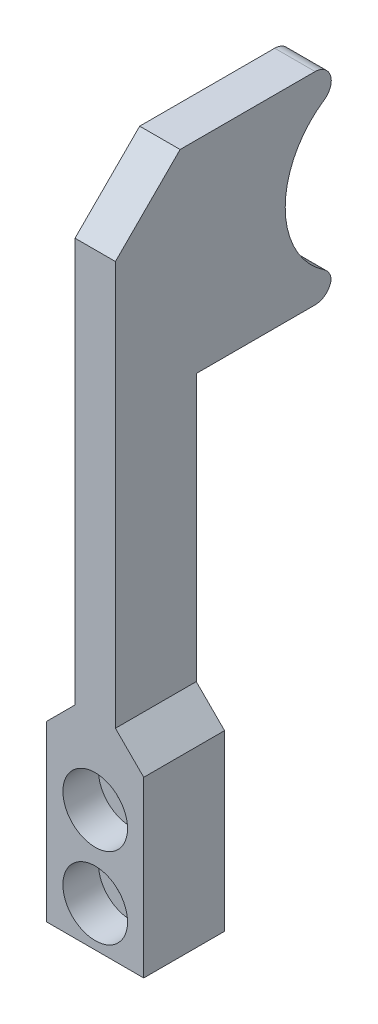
ISO-10303-21;
HEADER;
FILE_DESCRIPTION(('STEP AP214'),'2;1');
FILE_NAME('part.step','',(''),(''),'','','');
FILE_SCHEMA(('AUTOMOTIVE_DESIGN { 1 0 10303 214 1 1 1 1 }'));
ENDSEC;
DATA;
#1=APPLICATION_CONTEXT('core data for automotive mechanical design processes');
#2=APPLICATION_PROTOCOL_DEFINITION('international standard','automotive_design',2000,#1);
#3=PRODUCT_CONTEXT('',#1,'mechanical');
#4=PRODUCT('Part','Part','',(#3));
#5=PRODUCT_RELATED_PRODUCT_CATEGORY('part','',(#4));
#6=PRODUCT_DEFINITION_FORMATION('','',#4);
#7=PRODUCT_DEFINITION_CONTEXT('part definition',#1,'design');
#8=PRODUCT_DEFINITION('design','',#6,#7);
#9=PRODUCT_DEFINITION_SHAPE('','',#8);
#10=(LENGTH_UNIT() NAMED_UNIT(*) SI_UNIT(.MILLI.,.METRE.));
#11=(NAMED_UNIT(*) PLANE_ANGLE_UNIT() SI_UNIT($,.RADIAN.));
#12=(NAMED_UNIT(*) SI_UNIT($,.STERADIAN.) SOLID_ANGLE_UNIT());
#13=UNCERTAINTY_MEASURE_WITH_UNIT(LENGTH_MEASURE(1.E-05),#10,'distance_accuracy_value','');
#14=(GEOMETRIC_REPRESENTATION_CONTEXT(3) GLOBAL_UNCERTAINTY_ASSIGNED_CONTEXT((#13)) GLOBAL_UNIT_ASSIGNED_CONTEXT((#10,
#11,#12)) REPRESENTATION_CONTEXT('',''));
#15=CARTESIAN_POINT('',(0.,0.,0.));
#16=DIRECTION('',(0.,0.,1.));
#17=DIRECTION('',(1.,0.,0.));
#18=AXIS2_PLACEMENT_3D('',#15,#16,#17);
#19=CARTESIAN_POINT('',(0.,0.,24.));
#20=DIRECTION('',(0.,0.,1.));
#21=DIRECTION('',(1.,0.,0.));
#22=AXIS2_PLACEMENT_3D('',#19,#20,#21);
#23=PLANE('',#22);
#24=CARTESIAN_POINT('',(4.,-65.3,24.));
#25=DIRECTION('',(0.,0.,1.));
#26=DIRECTION('',(1.,0.,0.));
#27=AXIS2_PLACEMENT_3D('',#24,#25,#26);
#28=CIRCLE('',#27,2.25);
#29=CARTESIAN_POINT('',(6.25,-65.3,24.));
#30=VERTEX_POINT('',#29);
#31=EDGE_CURVE('E266',#30,#30,#28,.T.);
#32=ORIENTED_EDGE('',*,*,#31,.T.);
#33=EDGE_LOOP('',(#32));
#34=FACE_BOUND('',#33,.T.);
#35=CARTESIAN_POINT('',(4.,-55.3,24.));
#36=DIRECTION('',(0.,0.,1.));
#37=DIRECTION('',(1.,0.,0.));
#38=AXIS2_PLACEMENT_3D('',#35,#36,#37);
#39=CIRCLE('',#38,2.25);
#40=CARTESIAN_POINT('',(6.25,-55.3,24.));
#41=VERTEX_POINT('',#40);
#42=EDGE_CURVE('E256',#41,#41,#39,.T.);
#43=ORIENTED_EDGE('',*,*,#42,.T.);
#44=EDGE_LOOP('',(#43));
#45=FACE_BOUND('',#44,.T.);
#46=CARTESIAN_POINT('',(8.,-50.3,24.));
#47=DIRECTION('',(0.,0.,-1.));
#48=DIRECTION('',(-1.,0.,0.));
#49=AXIS2_PLACEMENT_3D('',#46,#47,#48);
#50=CIRCLE('',#49,0.999999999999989);
#51=CARTESIAN_POINT('',(8.,-51.3,24.));
#52=VERTEX_POINT('',#51);
#53=CARTESIAN_POINT('',(7.,-50.3,24.));
#54=VERTEX_POINT('',#53);
#55=EDGE_CURVE('E234',#52,#54,#50,.T.);
#56=ORIENTED_EDGE('',*,*,#55,.F.);
#57=DIRECTION('',(0.,-1.,0.));
#58=VECTOR('',#57,1.);
#59=CARTESIAN_POINT('',(8.,-70.3,24.));
#60=LINE('',#59,#58);
#61=CARTESIAN_POINT('',(8.,-70.3,24.));
#62=VERTEX_POINT('',#61);
#63=EDGE_CURVE('E291',#52,#62,#60,.T.);
#64=ORIENTED_EDGE('',*,*,#63,.T.);
#65=DIRECTION('',(-1.,0.,0.));
#66=VECTOR('',#65,1.);
#67=CARTESIAN_POINT('',(8.,-70.3,24.));
#68=LINE('',#67,#66);
#69=CARTESIAN_POINT('',(0.,-70.3,24.));
#70=VERTEX_POINT('',#69);
#71=EDGE_CURVE('E293',#62,#70,#68,.T.);
#72=ORIENTED_EDGE('',*,*,#71,.T.);
#73=DIRECTION('',(0.,1.,0.));
#74=VECTOR('',#73,1.);
#75=CARTESIAN_POINT('',(0.,-70.3,24.));
#76=LINE('',#75,#74);
#77=CARTESIAN_POINT('',(0.,-51.3,24.));
#78=VERTEX_POINT('',#77);
#79=EDGE_CURVE('E284',#70,#78,#76,.T.);
#80=ORIENTED_EDGE('',*,*,#79,.T.);
#81=CARTESIAN_POINT('',(0.,-50.3,24.));
#82=DIRECTION('',(0.,0.,-1.));
#83=DIRECTION('',(-1.,0.,0.));
#84=AXIS2_PLACEMENT_3D('',#81,#82,#83);
#85=CIRCLE('',#84,0.999999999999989);
#86=CARTESIAN_POINT('',(1.,-50.3,24.));
#87=VERTEX_POINT('',#86);
#88=EDGE_CURVE('E241',#87,#78,#85,.T.);
#89=ORIENTED_EDGE('',*,*,#88,.F.);
#90=DIRECTION('',(1.,0.,0.));
#91=VECTOR('',#90,1.);
#92=CARTESIAN_POINT('',(8.,-50.3,24.));
#93=LINE('',#92,#91);
#94=EDGE_CURVE('E287',#87,#54,#93,.T.);
#95=ORIENTED_EDGE('',*,*,#94,.T.);
#96=EDGE_LOOP('',(#56,#64,#72,#80,#89,#95));
#97=FACE_BOUND('',#96,.T.);
#98=ADVANCED_FACE('F16',(#34,#45,#97),#23,.F.);
#99=CARTESIAN_POINT('',(23.2,-12.3,3.9));
#100=DIRECTION('',(0.,1.,0.));
#101=DIRECTION('',(0.,0.,1.));
#102=AXIS2_PLACEMENT_3D('',#99,#100,#101);
#103=PLANE('',#102);
#104=DIRECTION('',(1.,0.,0.));
#105=VECTOR('',#104,1.);
#106=CARTESIAN_POINT('',(0.,-12.3,22.));
#107=LINE('',#106,#105);
#108=CARTESIAN_POINT('',(1.5,-12.3,22.));
#109=VERTEX_POINT('',#108);
#110=CARTESIAN_POINT('',(6.5,-12.3,22.));
#111=VERTEX_POINT('',#110);
#112=EDGE_CURVE('E321',#109,#111,#107,.T.);
#113=ORIENTED_EDGE('',*,*,#112,.F.);
#114=DIRECTION('',(0.,0.,-1.));
#115=VECTOR('',#114,1.);
#116=CARTESIAN_POINT('',(1.5,-12.3,3.9));
#117=LINE('',#116,#115);
#118=CARTESIAN_POINT('',(1.5,-12.3,7.3));
#119=VERTEX_POINT('',#118);
#120=EDGE_CURVE('E201',#109,#119,#117,.T.);
#121=ORIENTED_EDGE('',*,*,#120,.T.);
#122=DIRECTION('',(1.,0.,0.));
#123=VECTOR('',#122,1.);
#124=CARTESIAN_POINT('',(23.2,-12.3,7.3));
#125=LINE('',#124,#123);
#126=CARTESIAN_POINT('',(6.5,-12.3,7.3));
#127=VERTEX_POINT('',#126);
#128=EDGE_CURVE('E236',#119,#127,#125,.T.);
#129=ORIENTED_EDGE('',*,*,#128,.T.);
#130=DIRECTION('',(0.,0.,1.));
#131=VECTOR('',#130,1.);
#132=CARTESIAN_POINT('',(6.5,-12.3,3.9));
#133=LINE('',#132,#131);
#134=EDGE_CURVE('E226',#127,#111,#133,.T.);
#135=ORIENTED_EDGE('',*,*,#134,.T.);
#136=EDGE_LOOP('',(#113,#121,#129,#135));
#137=FACE_BOUND('',#136,.T.);
#138=ADVANCED_FACE('F360',(#137),#103,.F.);
#139=CARTESIAN_POINT('',(8.,0.,0.));
#140=DIRECTION('',(-1.,0.,0.));
#141=DIRECTION('',(0.,0.,1.));
#142=AXIS2_PLACEMENT_3D('',#139,#140,#141);
#143=CYLINDRICAL_SURFACE('',#142,11.);
#144=DIRECTION('',(-1.,0.,0.));
#145=VECTOR('',#144,1.);
#146=CARTESIAN_POINT('',(8.,-9.10195700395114,6.17692307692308));
#147=LINE('',#146,#145);
#148=CARTESIAN_POINT('',(6.5,-9.10195700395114,6.17692307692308));
#149=VERTEX_POINT('',#148);
#150=CARTESIAN_POINT('',(1.5,-9.10195700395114,6.17692307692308));
#151=VERTEX_POINT('',#150);
#152=EDGE_CURVE('E380',#149,#151,#147,.T.);
#153=ORIENTED_EDGE('',*,*,#152,.T.);
#154=CARTESIAN_POINT('',(1.5,0.,0.));
#155=DIRECTION('',(1.,0.,0.));
#156=DIRECTION('',(0.,1.,0.));
#157=AXIS2_PLACEMENT_3D('',#154,#155,#156);
#158=CIRCLE('',#157,11.);
#159=CARTESIAN_POINT('',(1.5,9.10195700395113,6.17692307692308));
#160=VERTEX_POINT('',#159);
#161=EDGE_CURVE('E194',#151,#160,#158,.F.);
#162=ORIENTED_EDGE('',*,*,#161,.T.);
#163=DIRECTION('',(-1.,0.,0.));
#164=VECTOR('',#163,1.);
#165=CARTESIAN_POINT('',(8.,9.10195700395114,6.17692307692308));
#166=LINE('',#165,#164);
#167=CARTESIAN_POINT('',(6.5,9.10195700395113,6.17692307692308));
#168=VERTEX_POINT('',#167);
#169=EDGE_CURVE('E384',#160,#168,#166,.F.);
#170=ORIENTED_EDGE('',*,*,#169,.T.);
#171=CARTESIAN_POINT('',(6.5,0.,0.));
#172=DIRECTION('',(-1.,0.,0.));
#173=DIRECTION('',(0.,0.,1.));
#174=AXIS2_PLACEMENT_3D('',#171,#172,#173);
#175=CIRCLE('',#174,11.);
#176=EDGE_CURVE('E218',#168,#149,#175,.F.);
#177=ORIENTED_EDGE('',*,*,#176,.T.);
#178=EDGE_LOOP('',(#153,#162,#170,#177));
#179=FACE_BOUND('',#178,.T.);
#180=ADVANCED_FACE('F407',(#179),#143,.F.);
#181=CARTESIAN_POINT('',(0.,12.7,0.));
#182=DIRECTION('',(0.,1.,0.));
#183=DIRECTION('',(0.,0.,1.));
#184=AXIS2_PLACEMENT_3D('',#181,#182,#183);
#185=PLANE('',#184);
#186=DIRECTION('',(0.,0.,1.));
#187=VECTOR('',#186,1.);
#188=CARTESIAN_POINT('',(1.5,12.7,5.30020206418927));
#189=LINE('',#188,#187);
#190=CARTESIAN_POINT('',(1.5,12.7,7.3));
#191=VERTEX_POINT('',#190);
#192=CARTESIAN_POINT('',(1.5,12.7,24.));
#193=VERTEX_POINT('',#192);
#194=EDGE_CURVE('E181',#191,#193,#189,.T.);
#195=ORIENTED_EDGE('',*,*,#194,.T.);
#196=DIRECTION('',(1.,0.,0.));
#197=VECTOR('',#196,1.);
#198=CARTESIAN_POINT('',(8.,12.7,24.));
#199=LINE('',#198,#197);
#200=CARTESIAN_POINT('',(6.5,12.7,24.));
#201=VERTEX_POINT('',#200);
#202=EDGE_CURVE('E237',#193,#201,#199,.T.);
#203=ORIENTED_EDGE('',*,*,#202,.T.);
#204=DIRECTION('',(0.,0.,1.));
#205=VECTOR('',#204,1.);
#206=CARTESIAN_POINT('',(6.5,12.7,5.30020206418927));
#207=LINE('',#206,#205);
#208=CARTESIAN_POINT('',(6.5,12.7,7.3));
#209=VERTEX_POINT('',#208);
#210=EDGE_CURVE('E210',#209,#201,#207,.T.);
#211=ORIENTED_EDGE('',*,*,#210,.F.);
#212=DIRECTION('',(1.,0.,0.));
#213=VECTOR('',#212,1.);
#214=CARTESIAN_POINT('',(0.,12.7,7.3));
#215=LINE('',#214,#213);
#216=EDGE_CURVE('E374',#209,#191,#215,.F.);
#217=ORIENTED_EDGE('',*,*,#216,.T.);
#218=EDGE_LOOP('',(#195,#203,#211,#217));
#219=FACE_BOUND('',#218,.T.);
#220=ADVANCED_FACE('F394',(#219),#185,.T.);
#221=CARTESIAN_POINT('',(19.2,12.7,32.));
#222=DIRECTION('',(0.,0.,-1.));
#223=DIRECTION('',(-1.,0.,0.));
#224=AXIS2_PLACEMENT_3D('',#221,#222,#223);
#225=PLANE('',#224);
#226=CARTESIAN_POINT('',(4.,-55.3,32.));
#227=DIRECTION('',(0.,0.,1.));
#228=DIRECTION('',(1.,0.,0.));
#229=AXIS2_PLACEMENT_3D('',#226,#227,#228);
#230=CIRCLE('',#229,4.);
#231=CARTESIAN_POINT('',(8.,-55.3,32.));
#232=VERTEX_POINT('',#231);
#233=EDGE_CURVE('E247',#232,#232,#230,.T.);
#234=ORIENTED_EDGE('',*,*,#233,.F.);
#235=EDGE_LOOP('',(#234));
#236=FACE_BOUND('',#235,.T.);
#237=CARTESIAN_POINT('',(4.,-65.3,32.));
#238=DIRECTION('',(0.,0.,1.));
#239=DIRECTION('',(1.,0.,0.));
#240=AXIS2_PLACEMENT_3D('',#237,#238,#239);
#241=CIRCLE('',#240,4.);
#242=CARTESIAN_POINT('',(8.,-65.3,32.));
#243=VERTEX_POINT('',#242);
#244=EDGE_CURVE('E257',#243,#243,#241,.T.);
#245=ORIENTED_EDGE('',*,*,#244,.F.);
#246=EDGE_LOOP('',(#245));
#247=FACE_BOUND('',#246,.T.);
#248=DIRECTION('',(0.,1.,0.));
#249=VECTOR('',#248,1.);
#250=CARTESIAN_POINT('',(1.5,-45.3,32.));
#251=LINE('',#250,#249);
#252=CARTESIAN_POINT('',(1.5,-45.3,32.));
#253=VERTEX_POINT('',#252);
#254=CARTESIAN_POINT('',(1.5,4.7,32.));
#255=VERTEX_POINT('',#254);
#256=EDGE_CURVE('E177',#253,#255,#251,.T.);
#257=ORIENTED_EDGE('',*,*,#256,.F.);
#258=DIRECTION('',(-0.707106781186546,-0.707106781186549,0.));
#259=VECTOR('',#258,1.);
#260=CARTESIAN_POINT('',(1.5,-45.3,32.));
#261=LINE('',#260,#259);
#262=CARTESIAN_POINT('',(-2.,-48.8,32.));
#263=VERTEX_POINT('',#262);
#264=EDGE_CURVE('E165',#253,#263,#261,.T.);
#265=ORIENTED_EDGE('',*,*,#264,.T.);
#266=DIRECTION('',(0.,-1.,0.));
#267=VECTOR('',#266,1.);
#268=CARTESIAN_POINT('',(-2.,-38.3,32.));
#269=LINE('',#268,#267);
#270=CARTESIAN_POINT('',(-2.,-70.3,32.));
#271=VERTEX_POINT('',#270);
#272=EDGE_CURVE('E314',#263,#271,#269,.T.);
#273=ORIENTED_EDGE('',*,*,#272,.T.);
#274=DIRECTION('',(-1.,0.,0.));
#275=VECTOR('',#274,1.);
#276=CARTESIAN_POINT('',(0.,-70.3,32.));
#277=LINE('',#276,#275);
#278=CARTESIAN_POINT('',(10.,-70.3,32.));
#279=VERTEX_POINT('',#278);
#280=EDGE_CURVE('E325',#279,#271,#277,.T.);
#281=ORIENTED_EDGE('',*,*,#280,.F.);
#282=DIRECTION('',(0.,1.,0.));
#283=VECTOR('',#282,1.);
#284=CARTESIAN_POINT('',(10.,-70.3,32.));
#285=LINE('',#284,#283);
#286=CARTESIAN_POINT('',(10.,-48.8,32.));
#287=VERTEX_POINT('',#286);
#288=EDGE_CURVE('E304',#279,#287,#285,.T.);
#289=ORIENTED_EDGE('',*,*,#288,.T.);
#290=DIRECTION('',(-0.707106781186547,0.707106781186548,0.));
#291=VECTOR('',#290,1.);
#292=CARTESIAN_POINT('',(6.5,-45.3,32.));
#293=LINE('',#292,#291);
#294=CARTESIAN_POINT('',(6.5,-45.3,32.));
#295=VERTEX_POINT('',#294);
#296=EDGE_CURVE('E172',#287,#295,#293,.T.);
#297=ORIENTED_EDGE('',*,*,#296,.T.);
#298=DIRECTION('',(0.,-1.,0.));
#299=VECTOR('',#298,1.);
#300=CARTESIAN_POINT('',(6.5,-45.3,32.));
#301=LINE('',#300,#299);
#302=CARTESIAN_POINT('',(6.5,4.7,32.));
#303=VERTEX_POINT('',#302);
#304=EDGE_CURVE('E207',#303,#295,#301,.T.);
#305=ORIENTED_EDGE('',*,*,#304,.F.);
#306=DIRECTION('',(-1.,0.,0.));
#307=VECTOR('',#306,1.);
#308=CARTESIAN_POINT('',(0.,4.7,32.));
#309=LINE('',#308,#307);
#310=EDGE_CURVE('E187',#303,#255,#309,.T.);
#311=ORIENTED_EDGE('',*,*,#310,.T.);
#312=EDGE_LOOP('',(#257,#265,#273,#281,#289,#297,#305,#311));
#313=FACE_BOUND('',#312,.T.);
#314=ADVANCED_FACE('F184',(#236,#247,#313),#225,.F.);
#315=CARTESIAN_POINT('',(0.,-70.3,22.));
#316=DIRECTION('',(0.,0.,1.));
#317=DIRECTION('',(1.,0.,0.));
#318=AXIS2_PLACEMENT_3D('',#315,#316,#317);
#319=PLANE('',#318);
#320=DIRECTION('',(0.,-1.,0.));
#321=VECTOR('',#320,1.);
#322=CARTESIAN_POINT('',(-2.,-38.3,22.));
#323=LINE('',#322,#321);
#324=CARTESIAN_POINT('',(-2.,-48.8,22.));
#325=VERTEX_POINT('',#324);
#326=CARTESIAN_POINT('',(-2.,-70.3,22.));
#327=VERTEX_POINT('',#326);
#328=EDGE_CURVE('E315',#325,#327,#323,.T.);
#329=ORIENTED_EDGE('',*,*,#328,.F.);
#330=DIRECTION('',(0.707106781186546,0.707106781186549,0.));
#331=VECTOR('',#330,1.);
#332=CARTESIAN_POINT('',(1.5,-45.3,22.));
#333=LINE('',#332,#331);
#334=CARTESIAN_POINT('',(1.5,-45.3,22.));
#335=VERTEX_POINT('',#334);
#336=EDGE_CURVE('E24',#325,#335,#333,.T.);
#337=ORIENTED_EDGE('',*,*,#336,.T.);
#338=DIRECTION('',(0.,1.,0.));
#339=VECTOR('',#338,1.);
#340=CARTESIAN_POINT('',(1.5,-70.3,22.));
#341=LINE('',#340,#339);
#342=EDGE_CURVE('E180',#335,#109,#341,.T.);
#343=ORIENTED_EDGE('',*,*,#342,.T.);
#344=ORIENTED_EDGE('',*,*,#112,.T.);
#345=DIRECTION('',(0.,-1.,0.));
#346=VECTOR('',#345,1.);
#347=CARTESIAN_POINT('',(6.5,-70.3,22.));
#348=LINE('',#347,#346);
#349=CARTESIAN_POINT('',(6.5,-45.3,22.));
#350=VERTEX_POINT('',#349);
#351=EDGE_CURVE('E229',#111,#350,#348,.T.);
#352=ORIENTED_EDGE('',*,*,#351,.T.);
#353=DIRECTION('',(0.707106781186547,-0.707106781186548,0.));
#354=VECTOR('',#353,1.);
#355=CARTESIAN_POINT('',(6.5,-45.3,22.));
#356=LINE('',#355,#354);
#357=CARTESIAN_POINT('',(10.,-48.8,22.));
#358=VERTEX_POINT('',#357);
#359=EDGE_CURVE('E31',#350,#358,#356,.T.);
#360=ORIENTED_EDGE('',*,*,#359,.T.);
#361=DIRECTION('',(0.,1.,0.));
#362=VECTOR('',#361,1.);
#363=CARTESIAN_POINT('',(10.,-70.3,22.));
#364=LINE('',#363,#362);
#365=CARTESIAN_POINT('',(10.,-70.3,22.));
#366=VERTEX_POINT('',#365);
#367=EDGE_CURVE('E307',#366,#358,#364,.T.);
#368=ORIENTED_EDGE('',*,*,#367,.F.);
#369=DIRECTION('',(1.,0.,0.));
#370=VECTOR('',#369,1.);
#371=CARTESIAN_POINT('',(0.,-70.3,22.));
#372=LINE('',#371,#370);
#373=CARTESIAN_POINT('',(8.,-70.3,22.));
#374=VERTEX_POINT('',#373);
#375=EDGE_CURVE('E326',#374,#366,#372,.T.);
#376=ORIENTED_EDGE('',*,*,#375,.F.);
#377=DIRECTION('',(0.,-1.,0.));
#378=VECTOR('',#377,1.);
#379=CARTESIAN_POINT('',(8.,-70.3,22.));
#380=LINE('',#379,#378);
#381=CARTESIAN_POINT('',(8.,-51.3,22.));
#382=VERTEX_POINT('',#381);
#383=EDGE_CURVE('E288',#382,#374,#380,.T.);
#384=ORIENTED_EDGE('',*,*,#383,.F.);
#385=CARTESIAN_POINT('',(8.,-50.3,22.));
#386=DIRECTION('',(0.,0.,-1.));
#387=DIRECTION('',(-1.,0.,0.));
#388=AXIS2_PLACEMENT_3D('',#385,#386,#387);
#389=CIRCLE('',#388,1.);
#390=CARTESIAN_POINT('',(7.,-50.3,22.));
#391=VERTEX_POINT('',#390);
#392=EDGE_CURVE('E275',#391,#382,#389,.T.);
#393=ORIENTED_EDGE('',*,*,#392,.F.);
#394=DIRECTION('',(1.,0.,0.));
#395=VECTOR('',#394,1.);
#396=CARTESIAN_POINT('',(8.,-50.3,22.));
#397=LINE('',#396,#395);
#398=CARTESIAN_POINT('',(1.,-50.3,22.));
#399=VERTEX_POINT('',#398);
#400=EDGE_CURVE('E299',#399,#391,#397,.T.);
#401=ORIENTED_EDGE('',*,*,#400,.F.);
#402=CARTESIAN_POINT('',(0.,-50.3,22.));
#403=DIRECTION('',(0.,0.,-1.));
#404=DIRECTION('',(-1.,0.,0.));
#405=AXIS2_PLACEMENT_3D('',#402,#403,#404);
#406=CIRCLE('',#405,1.);
#407=CARTESIAN_POINT('',(0.,-51.3,22.));
#408=VERTEX_POINT('',#407);
#409=EDGE_CURVE('E267',#408,#399,#406,.T.);
#410=ORIENTED_EDGE('',*,*,#409,.F.);
#411=DIRECTION('',(0.,1.,0.));
#412=VECTOR('',#411,1.);
#413=CARTESIAN_POINT('',(0.,-70.3,22.));
#414=LINE('',#413,#412);
#415=CARTESIAN_POINT('',(0.,-70.3,22.));
#416=VERTEX_POINT('',#415);
#417=EDGE_CURVE('E283',#416,#408,#414,.T.);
#418=ORIENTED_EDGE('',*,*,#417,.F.);
#419=EDGE_CURVE('E322',#327,#416,#372,.T.);
#420=ORIENTED_EDGE('',*,*,#419,.F.);
#421=EDGE_LOOP('',(#329,#337,#343,#344,#352,#360,#368,#376,#384,#393,#401,#410,#418,#420));
#422=FACE_BOUND('',#421,.T.);
#423=ADVANCED_FACE('F339',(#422),#319,.F.);
#424=CARTESIAN_POINT('',(0.,-70.3,0.));
#425=DIRECTION('',(0.,-1.,0.));
#426=DIRECTION('',(0.,0.,-1.));
#427=AXIS2_PLACEMENT_3D('',#424,#425,#426);
#428=PLANE('',#427);
#429=DIRECTION('',(0.,0.,-1.));
#430=VECTOR('',#429,1.);
#431=CARTESIAN_POINT('',(0.,-70.3,24.));
#432=LINE('',#431,#430);
#433=EDGE_CURVE('E302',#70,#416,#432,.T.);
#434=ORIENTED_EDGE('',*,*,#433,.F.);
#435=ORIENTED_EDGE('',*,*,#71,.F.);
#436=DIRECTION('',(0.,0.,-1.));
#437=VECTOR('',#436,1.);
#438=CARTESIAN_POINT('',(8.,-70.3,24.));
#439=LINE('',#438,#437);
#440=EDGE_CURVE('E296',#62,#374,#439,.T.);
#441=ORIENTED_EDGE('',*,*,#440,.T.);
#442=ORIENTED_EDGE('',*,*,#375,.T.);
#443=DIRECTION('',(0.,0.,1.));
#444=VECTOR('',#443,1.);
#445=CARTESIAN_POINT('',(10.,-70.3,22.));
#446=LINE('',#445,#444);
#447=EDGE_CURVE('E309',#366,#279,#446,.T.);
#448=ORIENTED_EDGE('',*,*,#447,.T.);
#449=ORIENTED_EDGE('',*,*,#280,.T.);
#450=DIRECTION('',(0.,0.,1.));
#451=VECTOR('',#450,1.);
#452=CARTESIAN_POINT('',(-2.,-70.3,22.));
#453=LINE('',#452,#451);
#454=EDGE_CURVE('E317',#327,#271,#453,.T.);
#455=ORIENTED_EDGE('',*,*,#454,.F.);
#456=ORIENTED_EDGE('',*,*,#419,.T.);
#457=EDGE_LOOP('',(#434,#435,#441,#442,#448,#449,#455,#456));
#458=FACE_BOUND('',#457,.T.);
#459=ADVANCED_FACE('F347',(#458),#428,.T.);
#460=CARTESIAN_POINT('',(19.2,4.7,32.));
#461=DIRECTION('',(0.,0.707106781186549,0.707106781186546));
#462=DIRECTION('',(1.,0.,0.));
#463=AXIS2_PLACEMENT_3D('',#460,#461,#462);
#464=PLANE('',#463);
#465=DIRECTION('',(0.,0.707106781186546,-0.707106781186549));
#466=VECTOR('',#465,1.);
#467=CARTESIAN_POINT('',(1.5,4.7,32.));
#468=LINE('',#467,#466);
#469=EDGE_CURVE('E205',#255,#193,#468,.T.);
#470=ORIENTED_EDGE('',*,*,#469,.F.);
#471=ORIENTED_EDGE('',*,*,#310,.F.);
#472=DIRECTION('',(0.,-0.707106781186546,0.707106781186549));
#473=VECTOR('',#472,1.);
#474=CARTESIAN_POINT('',(6.5,4.7,32.));
#475=LINE('',#474,#473);
#476=EDGE_CURVE('E231',#201,#303,#475,.T.);
#477=ORIENTED_EDGE('',*,*,#476,.F.);
#478=ORIENTED_EDGE('',*,*,#202,.F.);
#479=EDGE_LOOP('',(#470,#471,#477,#478));
#480=FACE_BOUND('',#479,.T.);
#481=ADVANCED_FACE('F397',(#480),#464,.T.);
#482=CARTESIAN_POINT('',(-2.,-38.3,22.));
#483=DIRECTION('',(-1.,0.,0.));
#484=DIRECTION('',(0.,-1.,0.));
#485=AXIS2_PLACEMENT_3D('',#482,#483,#484);
#486=PLANE('',#485);
#487=ORIENTED_EDGE('',*,*,#272,.F.);
#488=DIRECTION('',(0.,0.,-1.));
#489=VECTOR('',#488,1.);
#490=CARTESIAN_POINT('',(-2.,-48.8,22.));
#491=LINE('',#490,#489);
#492=EDGE_CURVE('E39',#263,#325,#491,.T.);
#493=ORIENTED_EDGE('',*,*,#492,.T.);
#494=ORIENTED_EDGE('',*,*,#328,.T.);
#495=ORIENTED_EDGE('',*,*,#454,.T.);
#496=EDGE_LOOP('',(#487,#493,#494,#495));
#497=FACE_BOUND('',#496,.T.);
#498=ADVANCED_FACE('F344',(#497),#486,.T.);
#499=CARTESIAN_POINT('',(10.,-70.3,22.));
#500=DIRECTION('',(1.,0.,0.));
#501=DIRECTION('',(0.,0.,-1.));
#502=AXIS2_PLACEMENT_3D('',#499,#500,#501);
#503=PLANE('',#502);
#504=ORIENTED_EDGE('',*,*,#367,.T.);
#505=DIRECTION('',(0.,0.,1.));
#506=VECTOR('',#505,1.);
#507=CARTESIAN_POINT('',(10.,-48.8,32.));
#508=LINE('',#507,#506);
#509=EDGE_CURVE('E11',#358,#287,#508,.T.);
#510=ORIENTED_EDGE('',*,*,#509,.T.);
#511=ORIENTED_EDGE('',*,*,#288,.F.);
#512=ORIENTED_EDGE('',*,*,#447,.F.);
#513=EDGE_LOOP('',(#504,#510,#511,#512));
#514=FACE_BOUND('',#513,.T.);
#515=ADVANCED_FACE('F448',(#514),#503,.T.);
#516=CARTESIAN_POINT('',(0.,-70.3,24.));
#517=DIRECTION('',(-1.,0.,0.));
#518=DIRECTION('',(0.,0.,1.));
#519=AXIS2_PLACEMENT_3D('',#516,#517,#518);
#520=PLANE('',#519);
#521=ORIENTED_EDGE('',*,*,#417,.T.);
#522=DIRECTION('',(0.,0.,-1.));
#523=VECTOR('',#522,1.);
#524=CARTESIAN_POINT('',(0.,-51.3,24.));
#525=LINE('',#524,#523);
#526=EDGE_CURVE('E272',#408,#78,#525,.F.);
#527=ORIENTED_EDGE('',*,*,#526,.T.);
#528=ORIENTED_EDGE('',*,*,#79,.F.);
#529=ORIENTED_EDGE('',*,*,#433,.T.);
#530=EDGE_LOOP('',(#521,#527,#528,#529));
#531=FACE_BOUND('',#530,.T.);
#532=ADVANCED_FACE('F441',(#531),#520,.F.);
#533=CARTESIAN_POINT('',(8.,-70.3,24.));
#534=DIRECTION('',(1.,0.,0.));
#535=DIRECTION('',(0.,0.,-1.));
#536=AXIS2_PLACEMENT_3D('',#533,#534,#535);
#537=PLANE('',#536);
#538=ORIENTED_EDGE('',*,*,#63,.F.);
#539=DIRECTION('',(0.,0.,-1.));
#540=VECTOR('',#539,1.);
#541=CARTESIAN_POINT('',(8.,-51.3,24.));
#542=LINE('',#541,#540);
#543=EDGE_CURVE('E280',#52,#382,#542,.T.);
#544=ORIENTED_EDGE('',*,*,#543,.T.);
#545=ORIENTED_EDGE('',*,*,#383,.T.);
#546=ORIENTED_EDGE('',*,*,#440,.F.);
#547=EDGE_LOOP('',(#538,#544,#545,#546));
#548=FACE_BOUND('',#547,.T.);
#549=ADVANCED_FACE('F437',(#548),#537,.F.);
#550=CARTESIAN_POINT('',(8.,-50.3,24.));
#551=DIRECTION('',(0.,1.,0.));
#552=DIRECTION('',(0.,0.,1.));
#553=AXIS2_PLACEMENT_3D('',#550,#551,#552);
#554=PLANE('',#553);
#555=ORIENTED_EDGE('',*,*,#94,.F.);
#556=DIRECTION('',(0.,0.,-1.));
#557=VECTOR('',#556,1.);
#558=CARTESIAN_POINT('',(1.,-50.3,24.));
#559=LINE('',#558,#557);
#560=EDGE_CURVE('E269',#87,#399,#559,.T.);
#561=ORIENTED_EDGE('',*,*,#560,.T.);
#562=ORIENTED_EDGE('',*,*,#400,.T.);
#563=DIRECTION('',(0.,0.,-1.));
#564=VECTOR('',#563,1.);
#565=CARTESIAN_POINT('',(7.,-50.3,24.));
#566=LINE('',#565,#564);
#567=EDGE_CURVE('E277',#391,#54,#566,.F.);
#568=ORIENTED_EDGE('',*,*,#567,.T.);
#569=EDGE_LOOP('',(#555,#561,#562,#568));
#570=FACE_BOUND('',#569,.T.);
#571=ADVANCED_FACE('F440',(#570),#554,.F.);
#572=CARTESIAN_POINT('',(8.,-50.3,24.));
#573=DIRECTION('',(0.,0.,-1.));
#574=DIRECTION('',(-1.,0.,0.));
#575=AXIS2_PLACEMENT_3D('',#572,#573,#574);
#576=CYLINDRICAL_SURFACE('',#575,1.);
#577=ORIENTED_EDGE('',*,*,#543,.F.);
#578=ORIENTED_EDGE('',*,*,#55,.T.);
#579=ORIENTED_EDGE('',*,*,#567,.F.);
#580=ORIENTED_EDGE('',*,*,#392,.T.);
#581=EDGE_LOOP('',(#577,#578,#579,#580));
#582=FACE_BOUND('',#581,.T.);
#583=CARTESIAN_POINT('',(8.,-50.3,25.));
#584=DIRECTION('',(0.,0.,-1.));
#585=DIRECTION('',(-1.,0.,0.));
#586=AXIS2_PLACEMENT_3D('',#583,#584,#585);
#587=CIRCLE('',#586,1.);
#588=CARTESIAN_POINT('',(7.,-50.3,25.));
#589=VERTEX_POINT('',#588);
#590=EDGE_CURVE('E238',#589,#589,#587,.T.);
#591=ORIENTED_EDGE('',*,*,#590,.F.);
#592=EDGE_LOOP('',(#591));
#593=FACE_BOUND('',#592,.T.);
#594=ADVANCED_FACE('F435',(#582,#593),#576,.F.);
#595=CARTESIAN_POINT('',(0.,-50.3,24.));
#596=DIRECTION('',(0.,0.,-1.));
#597=DIRECTION('',(-1.,0.,0.));
#598=AXIS2_PLACEMENT_3D('',#595,#596,#597);
#599=CYLINDRICAL_SURFACE('',#598,1.);
#600=ORIENTED_EDGE('',*,*,#409,.T.);
#601=ORIENTED_EDGE('',*,*,#560,.F.);
#602=ORIENTED_EDGE('',*,*,#88,.T.);
#603=ORIENTED_EDGE('',*,*,#526,.F.);
#604=EDGE_LOOP('',(#600,#601,#602,#603));
#605=FACE_BOUND('',#604,.T.);
#606=CARTESIAN_POINT('',(0.,-50.3,25.));
#607=DIRECTION('',(0.,0.,-1.));
#608=DIRECTION('',(-1.,0.,0.));
#609=AXIS2_PLACEMENT_3D('',#606,#607,#608);
#610=CIRCLE('',#609,1.);
#611=CARTESIAN_POINT('',(-0.999999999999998,-50.3,25.));
#612=VERTEX_POINT('',#611);
#613=EDGE_CURVE('E244',#612,#612,#610,.T.);
#614=ORIENTED_EDGE('',*,*,#613,.F.);
#615=EDGE_LOOP('',(#614));
#616=FACE_BOUND('',#615,.T.);
#617=ADVANCED_FACE('F507',(#605,#616),#599,.F.);
#618=CARTESIAN_POINT('',(4.,-65.3,32.));
#619=DIRECTION('',(0.,0.,1.));
#620=DIRECTION('',(1.,0.,0.));
#621=AXIS2_PLACEMENT_3D('',#618,#619,#620);
#622=CYLINDRICAL_SURFACE('',#621,2.25);
#623=CARTESIAN_POINT('',(4.,-65.3,27.6));
#624=DIRECTION('',(0.,0.,1.));
#625=DIRECTION('',(1.,0.,0.));
#626=AXIS2_PLACEMENT_3D('',#623,#624,#625);
#627=CIRCLE('',#626,2.25);
#628=CARTESIAN_POINT('',(6.25,-65.3,27.6));
#629=VERTEX_POINT('',#628);
#630=EDGE_CURVE('E263',#629,#629,#627,.T.);
#631=ORIENTED_EDGE('',*,*,#630,.T.);
#632=EDGE_LOOP('',(#631));
#633=FACE_BOUND('',#632,.T.);
#634=ORIENTED_EDGE('',*,*,#31,.F.);
#635=EDGE_LOOP('',(#634));
#636=FACE_BOUND('',#635,.T.);
#637=ADVANCED_FACE('F515',(#633,#636),#622,.F.);
#638=CARTESIAN_POINT('',(6.25,-65.3,27.6));
#639=DIRECTION('',(0.,0.,-1.));
#640=DIRECTION('',(-1.,0.,0.));
#641=AXIS2_PLACEMENT_3D('',#638,#639,#640);
#642=PLANE('',#641);
#643=ORIENTED_EDGE('',*,*,#630,.F.);
#644=EDGE_LOOP('',(#643));
#645=FACE_BOUND('',#644,.T.);
#646=CARTESIAN_POINT('',(4.,-65.3,27.6));
#647=DIRECTION('',(0.,0.,1.));
#648=DIRECTION('',(1.,0.,0.));
#649=AXIS2_PLACEMENT_3D('',#646,#647,#648);
#650=CIRCLE('',#649,4.);
#651=CARTESIAN_POINT('',(8.,-65.3,27.6));
#652=VERTEX_POINT('',#651);
#653=EDGE_CURVE('E260',#652,#652,#650,.T.);
#654=ORIENTED_EDGE('',*,*,#653,.T.);
#655=EDGE_LOOP('',(#654));
#656=FACE_BOUND('',#655,.T.);
#657=ADVANCED_FACE('F523',(#645,#656),#642,.F.);
#658=CARTESIAN_POINT('',(4.,-65.3,32.));
#659=DIRECTION('',(0.,0.,1.));
#660=DIRECTION('',(1.,0.,0.));
#661=AXIS2_PLACEMENT_3D('',#658,#659,#660);
#662=CYLINDRICAL_SURFACE('',#661,4.);
#663=ORIENTED_EDGE('',*,*,#653,.F.);
#664=EDGE_LOOP('',(#663));
#665=FACE_BOUND('',#664,.T.);
#666=ORIENTED_EDGE('',*,*,#244,.T.);
#667=EDGE_LOOP('',(#666));
#668=FACE_BOUND('',#667,.T.);
#669=ADVANCED_FACE('F532',(#665,#668),#662,.F.);
#670=CARTESIAN_POINT('',(4.,-55.3,32.));
#671=DIRECTION('',(0.,0.,1.));
#672=DIRECTION('',(1.,0.,0.));
#673=AXIS2_PLACEMENT_3D('',#670,#671,#672);
#674=CYLINDRICAL_SURFACE('',#673,2.25);
#675=CARTESIAN_POINT('',(4.,-55.3,27.6));
#676=DIRECTION('',(0.,0.,1.));
#677=DIRECTION('',(1.,0.,0.));
#678=AXIS2_PLACEMENT_3D('',#675,#676,#677);
#679=CIRCLE('',#678,2.25);
#680=CARTESIAN_POINT('',(6.25,-55.3,27.6));
#681=VERTEX_POINT('',#680);
#682=EDGE_CURVE('E253',#681,#681,#679,.T.);
#683=ORIENTED_EDGE('',*,*,#682,.T.);
#684=EDGE_LOOP('',(#683));
#685=FACE_BOUND('',#684,.T.);
#686=ORIENTED_EDGE('',*,*,#42,.F.);
#687=EDGE_LOOP('',(#686));
#688=FACE_BOUND('',#687,.T.);
#689=ADVANCED_FACE('F541',(#685,#688),#674,.F.);
#690=CARTESIAN_POINT('',(6.25,-55.3,27.6));
#691=DIRECTION('',(0.,0.,-1.));
#692=DIRECTION('',(-1.,0.,0.));
#693=AXIS2_PLACEMENT_3D('',#690,#691,#692);
#694=PLANE('',#693);
#695=ORIENTED_EDGE('',*,*,#682,.F.);
#696=EDGE_LOOP('',(#695));
#697=FACE_BOUND('',#696,.T.);
#698=CARTESIAN_POINT('',(4.,-55.3,27.6));
#699=DIRECTION('',(0.,0.,1.));
#700=DIRECTION('',(1.,0.,0.));
#701=AXIS2_PLACEMENT_3D('',#698,#699,#700);
#702=CIRCLE('',#701,4.);
#703=CARTESIAN_POINT('',(8.,-55.3,27.6));
#704=VERTEX_POINT('',#703);
#705=EDGE_CURVE('E250',#704,#704,#702,.T.);
#706=ORIENTED_EDGE('',*,*,#705,.T.);
#707=EDGE_LOOP('',(#706));
#708=FACE_BOUND('',#707,.T.);
#709=ADVANCED_FACE('F550',(#697,#708),#694,.F.);
#710=CARTESIAN_POINT('',(4.,-55.3,32.));
#711=DIRECTION('',(0.,0.,1.));
#712=DIRECTION('',(1.,0.,0.));
#713=AXIS2_PLACEMENT_3D('',#710,#711,#712);
#714=CYLINDRICAL_SURFACE('',#713,4.);
#715=ORIENTED_EDGE('',*,*,#705,.F.);
#716=EDGE_LOOP('',(#715));
#717=FACE_BOUND('',#716,.T.);
#718=ORIENTED_EDGE('',*,*,#233,.T.);
#719=EDGE_LOOP('',(#718));
#720=FACE_BOUND('',#719,.T.);
#721=ADVANCED_FACE('F559',(#717,#720),#714,.F.);
#722=CARTESIAN_POINT('',(0.,-50.3,25.));
#723=DIRECTION('',(0.,0.,-1.));
#724=DIRECTION('',(-1.,0.,0.));
#725=AXIS2_PLACEMENT_3D('',#722,#723,#724);
#726=CONICAL_SURFACE('',#725,1.,1.02974425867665);
#727=CARTESIAN_POINT('',(0.,-50.3,25.6008606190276));
#728=VERTEX_POINT('',#727);
#729=VERTEX_LOOP('',#728);
#730=FACE_BOUND('',#729,.T.);
#731=ORIENTED_EDGE('',*,*,#613,.T.);
#732=EDGE_LOOP('',(#731));
#733=FACE_BOUND('',#732,.T.);
#734=ADVANCED_FACE('F420',(#730,#733),#726,.F.);
#735=CARTESIAN_POINT('',(8.,-50.3,25.));
#736=DIRECTION('',(0.,0.,-1.));
#737=DIRECTION('',(-1.,0.,0.));
#738=AXIS2_PLACEMENT_3D('',#735,#736,#737);
#739=CONICAL_SURFACE('',#738,1.,1.02974425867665);
#740=CARTESIAN_POINT('',(8.,-50.3,25.6008606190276));
#741=VERTEX_POINT('',#740);
#742=VERTEX_LOOP('',#741);
#743=FACE_BOUND('',#742,.T.);
#744=ORIENTED_EDGE('',*,*,#590,.T.);
#745=EDGE_LOOP('',(#744));
#746=FACE_BOUND('',#745,.T.);
#747=ADVANCED_FACE('F411',(#743,#746),#739,.F.);
#748=CARTESIAN_POINT('',(8.,-10.7568582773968,7.3));
#749=DIRECTION('',(-1.,0.,0.));
#750=DIRECTION('',(0.,0.,1.));
#751=AXIS2_PLACEMENT_3D('',#748,#749,#750);
#752=CYLINDRICAL_SURFACE('',#751,2.);
#753=CARTESIAN_POINT('',(1.5,-10.7568582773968,7.3));
#754=DIRECTION('',(1.,0.,0.));
#755=DIRECTION('',(0.,1.,0.));
#756=AXIS2_PLACEMENT_3D('',#753,#754,#755);
#757=CIRCLE('',#756,2.);
#758=CARTESIAN_POINT('',(1.5,-10.5284291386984,5.31308779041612));
#759=VERTEX_POINT('',#758);
#760=EDGE_CURVE('E197',#151,#759,#757,.F.);
#761=ORIENTED_EDGE('',*,*,#760,.F.);
#762=ORIENTED_EDGE('',*,*,#152,.F.);
#763=CARTESIAN_POINT('',(6.5,-10.7568582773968,7.3));
#764=DIRECTION('',(-1.,0.,0.));
#765=DIRECTION('',(0.,0.,1.));
#766=AXIS2_PLACEMENT_3D('',#763,#764,#765);
#767=CIRCLE('',#766,2.);
#768=CARTESIAN_POINT('',(6.5,-10.5284291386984,5.31308779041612));
#769=VERTEX_POINT('',#768);
#770=EDGE_CURVE('E221',#769,#149,#767,.F.);
#771=ORIENTED_EDGE('',*,*,#770,.F.);
#772=DIRECTION('',(-1.,0.,0.));
#773=VECTOR('',#772,1.);
#774=CARTESIAN_POINT('',(4.,-10.5284291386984,5.31308779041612));
#775=LINE('',#774,#773);
#776=EDGE_CURVE('E242',#759,#769,#775,.F.);
#777=ORIENTED_EDGE('',*,*,#776,.F.);
#778=EDGE_LOOP('',(#761,#762,#771,#777));
#779=FACE_BOUND('',#778,.T.);
#780=ADVANCED_FACE('F409',(#779),#752,.T.);
#781=CARTESIAN_POINT('',(23.2,-10.3,7.3));
#782=DIRECTION('',(1.,0.,0.));
#783=DIRECTION('',(0.,0.,-1.));
#784=AXIS2_PLACEMENT_3D('',#781,#782,#783);
#785=CYLINDRICAL_SURFACE('',#784,2.);
#786=CARTESIAN_POINT('',(1.5,-10.3,7.3));
#787=DIRECTION('',(1.,0.,0.));
#788=DIRECTION('',(0.,1.,0.));
#789=AXIS2_PLACEMENT_3D('',#786,#787,#788);
#790=CIRCLE('',#789,2.);
#791=EDGE_CURVE('E199',#759,#119,#790,.F.);
#792=ORIENTED_EDGE('',*,*,#791,.F.);
#793=ORIENTED_EDGE('',*,*,#776,.T.);
#794=CARTESIAN_POINT('',(6.5,-10.3,7.3));
#795=DIRECTION('',(-1.,0.,0.));
#796=DIRECTION('',(0.,0.,1.));
#797=AXIS2_PLACEMENT_3D('',#794,#795,#796);
#798=CIRCLE('',#797,2.);
#799=EDGE_CURVE('E223',#127,#769,#798,.F.);
#800=ORIENTED_EDGE('',*,*,#799,.F.);
#801=ORIENTED_EDGE('',*,*,#128,.F.);
#802=EDGE_LOOP('',(#792,#793,#800,#801));
#803=FACE_BOUND('',#802,.T.);
#804=ADVANCED_FACE('F366',(#803),#785,.T.);
#805=CARTESIAN_POINT('',(8.,10.7568582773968,7.3));
#806=DIRECTION('',(-1.,0.,0.));
#807=DIRECTION('',(0.,0.,1.));
#808=AXIS2_PLACEMENT_3D('',#805,#806,#807);
#809=CYLINDRICAL_SURFACE('',#808,2.);
#810=CARTESIAN_POINT('',(1.5,10.7568582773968,7.3));
#811=DIRECTION('',(1.,0.,0.));
#812=DIRECTION('',(0.,1.,0.));
#813=AXIS2_PLACEMENT_3D('',#810,#811,#812);
#814=CIRCLE('',#813,2.);
#815=CARTESIAN_POINT('',(1.5,10.7284291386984,5.30020206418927));
#816=VERTEX_POINT('',#815);
#817=EDGE_CURVE('E191',#816,#160,#814,.F.);
#818=ORIENTED_EDGE('',*,*,#817,.F.);
#819=DIRECTION('',(-1.,0.,0.));
#820=VECTOR('',#819,1.);
#821=CARTESIAN_POINT('',(4.,10.7284291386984,5.30020206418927));
#822=LINE('',#821,#820);
#823=CARTESIAN_POINT('',(6.5,10.7284291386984,5.30020206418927));
#824=VERTEX_POINT('',#823);
#825=EDGE_CURVE('E233',#824,#816,#822,.T.);
#826=ORIENTED_EDGE('',*,*,#825,.F.);
#827=CARTESIAN_POINT('',(6.5,10.7568582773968,7.3));
#828=DIRECTION('',(-1.,0.,0.));
#829=DIRECTION('',(0.,0.,1.));
#830=AXIS2_PLACEMENT_3D('',#827,#828,#829);
#831=CIRCLE('',#830,2.);
#832=EDGE_CURVE('E214',#168,#824,#831,.F.);
#833=ORIENTED_EDGE('',*,*,#832,.F.);
#834=ORIENTED_EDGE('',*,*,#169,.F.);
#835=EDGE_LOOP('',(#818,#826,#833,#834));
#836=FACE_BOUND('',#835,.T.);
#837=ADVANCED_FACE('F405',(#836),#809,.T.);
#838=CARTESIAN_POINT('',(-2.,10.7,7.3));
#839=DIRECTION('',(-1.,0.,0.));
#840=DIRECTION('',(0.,0.,1.));
#841=AXIS2_PLACEMENT_3D('',#838,#839,#840);
#842=CYLINDRICAL_SURFACE('',#841,2.);
#843=CARTESIAN_POINT('',(1.5,10.7,7.3));
#844=DIRECTION('',(1.,0.,0.));
#845=DIRECTION('',(0.,1.,0.));
#846=AXIS2_PLACEMENT_3D('',#843,#844,#845);
#847=CIRCLE('',#846,2.);
#848=EDGE_CURVE('E335',#191,#816,#847,.F.);
#849=ORIENTED_EDGE('',*,*,#848,.F.);
#850=ORIENTED_EDGE('',*,*,#216,.F.);
#851=CARTESIAN_POINT('',(6.5,10.7,7.3));
#852=DIRECTION('',(-1.,0.,0.));
#853=DIRECTION('',(0.,0.,1.));
#854=AXIS2_PLACEMENT_3D('',#851,#852,#853);
#855=CIRCLE('',#854,2.);
#856=EDGE_CURVE('E376',#824,#209,#855,.F.);
#857=ORIENTED_EDGE('',*,*,#856,.F.);
#858=ORIENTED_EDGE('',*,*,#825,.T.);
#859=EDGE_LOOP('',(#849,#850,#857,#858));
#860=FACE_BOUND('',#859,.T.);
#861=ADVANCED_FACE('F401',(#860),#842,.T.);
#862=CARTESIAN_POINT('',(6.5,-45.3,5.30020206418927));
#863=DIRECTION('',(-1.,0.,0.));
#864=DIRECTION('',(0.,0.,1.));
#865=AXIS2_PLACEMENT_3D('',#862,#863,#864);
#866=PLANE('',#865);
#867=ORIENTED_EDGE('',*,*,#476,.T.);
#868=ORIENTED_EDGE('',*,*,#304,.T.);
#869=DIRECTION('',(0.,0.,1.));
#870=VECTOR('',#869,1.);
#871=CARTESIAN_POINT('',(6.5,-45.3,5.30020206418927));
#872=LINE('',#871,#870);
#873=EDGE_CURVE('E211',#350,#295,#872,.T.);
#874=ORIENTED_EDGE('',*,*,#873,.F.);
#875=ORIENTED_EDGE('',*,*,#351,.F.);
#876=ORIENTED_EDGE('',*,*,#134,.F.);
#877=ORIENTED_EDGE('',*,*,#799,.T.);
#878=ORIENTED_EDGE('',*,*,#770,.T.);
#879=ORIENTED_EDGE('',*,*,#176,.F.);
#880=ORIENTED_EDGE('',*,*,#832,.T.);
#881=ORIENTED_EDGE('',*,*,#856,.T.);
#882=ORIENTED_EDGE('',*,*,#210,.T.);
#883=EDGE_LOOP('',(#867,#868,#874,#875,#876,#877,#878,#879,#880,#881,#882));
#884=FACE_BOUND('',#883,.T.);
#885=ADVANCED_FACE('F357',(#884),#866,.F.);
#886=CARTESIAN_POINT('',(1.5,-45.3,5.30020206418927));
#887=DIRECTION('',(1.,0.,0.));
#888=DIRECTION('',(0.,1.,0.));
#889=AXIS2_PLACEMENT_3D('',#886,#887,#888);
#890=PLANE('',#889);
#891=ORIENTED_EDGE('',*,*,#469,.T.);
#892=ORIENTED_EDGE('',*,*,#194,.F.);
#893=ORIENTED_EDGE('',*,*,#848,.T.);
#894=ORIENTED_EDGE('',*,*,#817,.T.);
#895=ORIENTED_EDGE('',*,*,#161,.F.);
#896=ORIENTED_EDGE('',*,*,#760,.T.);
#897=ORIENTED_EDGE('',*,*,#791,.T.);
#898=ORIENTED_EDGE('',*,*,#120,.F.);
#899=ORIENTED_EDGE('',*,*,#342,.F.);
#900=DIRECTION('',(0.,0.,1.));
#901=VECTOR('',#900,1.);
#902=CARTESIAN_POINT('',(1.5,-45.3,5.30020206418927));
#903=LINE('',#902,#901);
#904=EDGE_CURVE('E169',#335,#253,#903,.T.);
#905=ORIENTED_EDGE('',*,*,#904,.T.);
#906=ORIENTED_EDGE('',*,*,#256,.T.);
#907=EDGE_LOOP('',(#891,#892,#893,#894,#895,#896,#897,#898,#899,#905,#906));
#908=FACE_BOUND('',#907,.T.);
#909=ADVANCED_FACE('F176',(#908),#890,.F.);
#910=CARTESIAN_POINT('',(1.5,-45.3,5.30020206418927));
#911=DIRECTION('',(-0.707106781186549,0.707106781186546,0.));
#912=DIRECTION('',(0.,0.,-1.));
#913=AXIS2_PLACEMENT_3D('',#910,#911,#912);
#914=PLANE('',#913);
#915=ORIENTED_EDGE('',*,*,#336,.F.);
#916=ORIENTED_EDGE('',*,*,#492,.F.);
#917=ORIENTED_EDGE('',*,*,#264,.F.);
#918=ORIENTED_EDGE('',*,*,#904,.F.);
#919=EDGE_LOOP('',(#915,#916,#917,#918));
#920=FACE_BOUND('',#919,.T.);
#921=ADVANCED_FACE('F168',(#920),#914,.T.);
#922=CARTESIAN_POINT('',(6.5,-45.3,5.30020206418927));
#923=DIRECTION('',(0.707106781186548,0.707106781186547,0.));
#924=DIRECTION('',(0.,0.,1.));
#925=AXIS2_PLACEMENT_3D('',#922,#923,#924);
#926=PLANE('',#925);
#927=ORIENTED_EDGE('',*,*,#296,.F.);
#928=ORIENTED_EDGE('',*,*,#509,.F.);
#929=ORIENTED_EDGE('',*,*,#359,.F.);
#930=ORIENTED_EDGE('',*,*,#873,.T.);
#931=EDGE_LOOP('',(#927,#928,#929,#930));
#932=FACE_BOUND('',#931,.T.);
#933=ADVANCED_FACE('F18',(#932),#926,.T.);
#934=CLOSED_SHELL('',(#98,#138,#180,#220,#314,#423,#459,#481,#498,#515,#532,#549,#571,#594,#617,
#637,#657,#669,#689,#709,#721,#734,#747,#780,#804,#837,#861,#885,#909,#921,#933));
#935=MANIFOLD_SOLID_BREP('B1',#934);
#936=ADVANCED_BREP_SHAPE_REPRESENTATION('',(#18,#935),#14);
#937=SHAPE_DEFINITION_REPRESENTATION(#9,#936);
ENDSEC;
END-ISO-10303-21;
